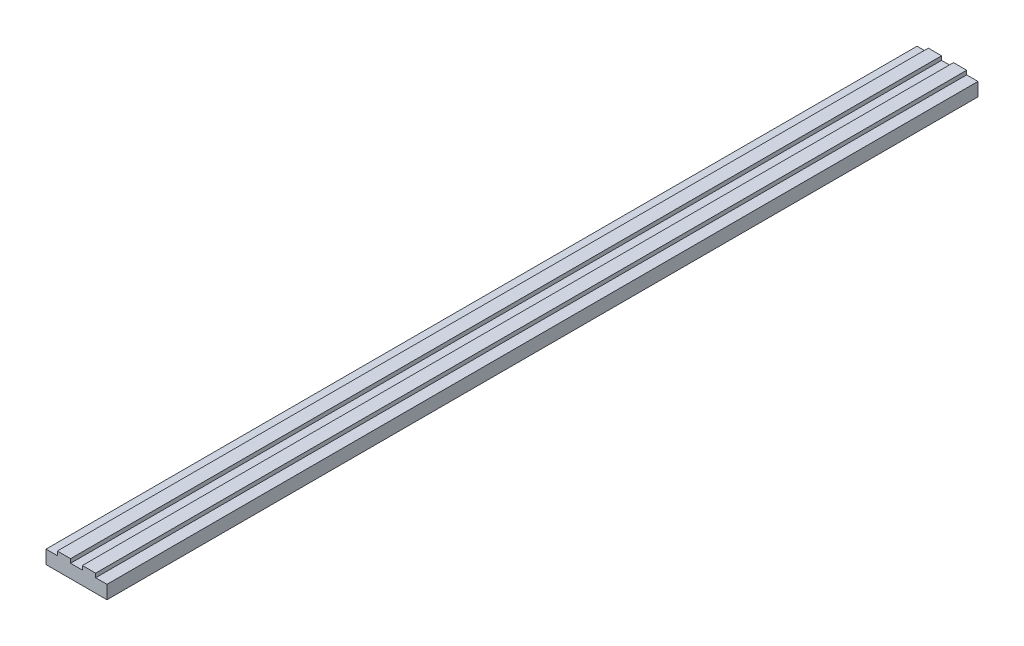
ISO-10303-21;
HEADER;
FILE_DESCRIPTION(('STEP AP214'),'2;1');
FILE_NAME('part.step','',(''),(''),'','','');
FILE_SCHEMA(('AUTOMOTIVE_DESIGN { 1 0 10303 214 1 1 1 1 }'));
ENDSEC;
DATA;
#1=APPLICATION_CONTEXT('core data for automotive mechanical design processes');
#2=APPLICATION_PROTOCOL_DEFINITION('international standard','automotive_design',2000,#1);
#3=PRODUCT_CONTEXT('',#1,'mechanical');
#4=PRODUCT('Part','Part','',(#3));
#5=PRODUCT_RELATED_PRODUCT_CATEGORY('part','',(#4));
#6=PRODUCT_DEFINITION_FORMATION('','',#4);
#7=PRODUCT_DEFINITION_CONTEXT('part definition',#1,'design');
#8=PRODUCT_DEFINITION('design','',#6,#7);
#9=PRODUCT_DEFINITION_SHAPE('','',#8);
#10=(LENGTH_UNIT() NAMED_UNIT(*) SI_UNIT(.MILLI.,.METRE.));
#11=(NAMED_UNIT(*) PLANE_ANGLE_UNIT() SI_UNIT($,.RADIAN.));
#12=(NAMED_UNIT(*) SI_UNIT($,.STERADIAN.) SOLID_ANGLE_UNIT());
#13=UNCERTAINTY_MEASURE_WITH_UNIT(LENGTH_MEASURE(1.E-05),#10,'distance_accuracy_value','');
#14=(GEOMETRIC_REPRESENTATION_CONTEXT(3) GLOBAL_UNCERTAINTY_ASSIGNED_CONTEXT((#13)) GLOBAL_UNIT_ASSIGNED_CONTEXT((#10,
#11,#12)) REPRESENTATION_CONTEXT('',''));
#15=CARTESIAN_POINT('',(0.,0.,0.));
#16=DIRECTION('',(0.,0.,1.));
#17=DIRECTION('',(1.,0.,0.));
#18=AXIS2_PLACEMENT_3D('',#15,#16,#17);
#19=CARTESIAN_POINT('',(-3.3999999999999,10.,0.));
#20=DIRECTION('',(-1.,0.,0.));
#21=DIRECTION('',(0.,0.,1.));
#22=AXIS2_PLACEMENT_3D('',#19,#20,#21);
#23=PLANE('',#22);
#24=DIRECTION('',(0.,-1.,0.));
#25=VECTOR('',#24,1.);
#26=CARTESIAN_POINT('',(-3.3999999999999,10.,500.));
#27=LINE('',#26,#25);
#28=CARTESIAN_POINT('',(-3.3999999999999,10.,500.));
#29=VERTEX_POINT('',#28);
#30=CARTESIAN_POINT('',(-3.3999999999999,7.7,500.));
#31=VERTEX_POINT('',#30);
#32=EDGE_CURVE('E133',#29,#31,#27,.T.);
#33=ORIENTED_EDGE('',*,*,#32,.T.);
#34=DIRECTION('',(0.,0.,1.));
#35=VECTOR('',#34,1.);
#36=CARTESIAN_POINT('',(-3.3999999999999,7.7,0.));
#37=LINE('',#36,#35);
#38=CARTESIAN_POINT('',(-3.3999999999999,7.7,0.));
#39=VERTEX_POINT('',#38);
#40=EDGE_CURVE('E9',#39,#31,#37,.T.);
#41=ORIENTED_EDGE('',*,*,#40,.F.);
#42=DIRECTION('',(0.,-1.,0.));
#43=VECTOR('',#42,1.);
#44=CARTESIAN_POINT('',(-3.3999999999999,10.,0.));
#45=LINE('',#44,#43);
#46=CARTESIAN_POINT('',(-3.3999999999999,10.,0.));
#47=VERTEX_POINT('',#46);
#48=EDGE_CURVE('E161',#47,#39,#45,.T.);
#49=ORIENTED_EDGE('',*,*,#48,.F.);
#50=DIRECTION('',(0.,0.,1.));
#51=VECTOR('',#50,1.);
#52=CARTESIAN_POINT('',(-3.3999999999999,10.,0.));
#53=LINE('',#52,#51);
#54=EDGE_CURVE('E129',#47,#29,#53,.T.);
#55=ORIENTED_EDGE('',*,*,#54,.T.);
#56=EDGE_LOOP('',(#33,#41,#49,#55));
#57=FACE_BOUND('',#56,.T.);
#58=ADVANCED_FACE('F14',(#57),#23,.F.);
#59=CARTESIAN_POINT('',(-3.3999999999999,7.7,0.));
#60=DIRECTION('',(0.,-1.,0.));
#61=DIRECTION('',(0.,0.,-1.));
#62=AXIS2_PLACEMENT_3D('',#59,#60,#61);
#63=PLANE('',#62);
#64=DIRECTION('',(1.,0.,0.));
#65=VECTOR('',#64,1.);
#66=CARTESIAN_POINT('',(-3.3999999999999,7.7,500.));
#67=LINE('',#66,#65);
#68=CARTESIAN_POINT('',(3.40000000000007,7.7,500.));
#69=VERTEX_POINT('',#68);
#70=EDGE_CURVE('E136',#31,#69,#67,.T.);
#71=ORIENTED_EDGE('',*,*,#70,.T.);
#72=DIRECTION('',(0.,0.,1.));
#73=VECTOR('',#72,1.);
#74=CARTESIAN_POINT('',(3.40000000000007,7.7,0.));
#75=LINE('',#74,#73);
#76=CARTESIAN_POINT('',(3.40000000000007,7.7,0.));
#77=VERTEX_POINT('',#76);
#78=EDGE_CURVE('E22',#77,#69,#75,.T.);
#79=ORIENTED_EDGE('',*,*,#78,.F.);
#80=DIRECTION('',(1.,0.,0.));
#81=VECTOR('',#80,1.);
#82=CARTESIAN_POINT('',(-3.3999999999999,7.7,0.));
#83=LINE('',#82,#81);
#84=EDGE_CURVE('E81',#39,#77,#83,.T.);
#85=ORIENTED_EDGE('',*,*,#84,.F.);
#86=ORIENTED_EDGE('',*,*,#40,.T.);
#87=EDGE_LOOP('',(#71,#79,#85,#86));
#88=FACE_BOUND('',#87,.T.);
#89=ADVANCED_FACE('F185',(#88),#63,.F.);
#90=CARTESIAN_POINT('',(3.4,10.,0.));
#91=DIRECTION('',(-1.,0.,0.));
#92=DIRECTION('',(0.,-1.,0.));
#93=AXIS2_PLACEMENT_3D('',#90,#91,#92);
#94=PLANE('',#93);
#95=DIRECTION('',(0.,-1.,0.));
#96=VECTOR('',#95,1.);
#97=CARTESIAN_POINT('',(3.4,10.,500.));
#98=LINE('',#97,#96);
#99=CARTESIAN_POINT('',(3.4,10.,500.));
#100=VERTEX_POINT('',#99);
#101=EDGE_CURVE('E139',#100,#69,#98,.T.);
#102=ORIENTED_EDGE('',*,*,#101,.F.);
#103=DIRECTION('',(0.,0.,1.));
#104=VECTOR('',#103,1.);
#105=CARTESIAN_POINT('',(3.4,10.,0.));
#106=LINE('',#105,#104);
#107=CARTESIAN_POINT('',(3.4,10.,0.));
#108=VERTEX_POINT('',#107);
#109=EDGE_CURVE('E178',#108,#100,#106,.T.);
#110=ORIENTED_EDGE('',*,*,#109,.F.);
#111=DIRECTION('',(0.,-1.,0.));
#112=VECTOR('',#111,1.);
#113=CARTESIAN_POINT('',(3.4,10.,0.));
#114=LINE('',#113,#112);
#115=EDGE_CURVE('E184',#108,#77,#114,.T.);
#116=ORIENTED_EDGE('',*,*,#115,.T.);
#117=ORIENTED_EDGE('',*,*,#78,.T.);
#118=EDGE_LOOP('',(#102,#110,#116,#117));
#119=FACE_BOUND('',#118,.T.);
#120=ADVANCED_FACE('F182',(#119),#94,.T.);
#121=CARTESIAN_POINT('',(3.4,10.,0.));
#122=DIRECTION('',(0.,-1.,0.));
#123=DIRECTION('',(1.,0.,0.));
#124=AXIS2_PLACEMENT_3D('',#121,#122,#123);
#125=PLANE('',#124);
#126=DIRECTION('',(1.,0.,0.));
#127=VECTOR('',#126,1.);
#128=CARTESIAN_POINT('',(3.4,10.,500.));
#129=LINE('',#128,#127);
#130=CARTESIAN_POINT('',(11.,10.,500.));
#131=VERTEX_POINT('',#130);
#132=EDGE_CURVE('E142',#100,#131,#129,.T.);
#133=ORIENTED_EDGE('',*,*,#132,.T.);
#134=DIRECTION('',(0.,0.,1.));
#135=VECTOR('',#134,1.);
#136=CARTESIAN_POINT('',(11.,10.,0.));
#137=LINE('',#136,#135);
#138=CARTESIAN_POINT('',(11.,10.,0.));
#139=VERTEX_POINT('',#138);
#140=EDGE_CURVE('E175',#139,#131,#137,.T.);
#141=ORIENTED_EDGE('',*,*,#140,.F.);
#142=DIRECTION('',(1.,0.,0.));
#143=VECTOR('',#142,1.);
#144=CARTESIAN_POINT('',(3.4,10.,0.));
#145=LINE('',#144,#143);
#146=EDGE_CURVE('E204',#108,#139,#145,.T.);
#147=ORIENTED_EDGE('',*,*,#146,.F.);
#148=ORIENTED_EDGE('',*,*,#109,.T.);
#149=EDGE_LOOP('',(#133,#141,#147,#148));
#150=FACE_BOUND('',#149,.T.);
#151=ADVANCED_FACE('F195',(#150),#125,.F.);
#152=CARTESIAN_POINT('',(11.,10.,0.));
#153=DIRECTION('',(-1.,0.,0.));
#154=DIRECTION('',(0.,0.,1.));
#155=AXIS2_PLACEMENT_3D('',#152,#153,#154);
#156=PLANE('',#155);
#157=DIRECTION('',(0.,-1.,0.));
#158=VECTOR('',#157,1.);
#159=CARTESIAN_POINT('',(11.,10.,500.));
#160=LINE('',#159,#158);
#161=CARTESIAN_POINT('',(11.,7.7,500.));
#162=VERTEX_POINT('',#161);
#163=EDGE_CURVE('E144',#131,#162,#160,.T.);
#164=ORIENTED_EDGE('',*,*,#163,.T.);
#165=DIRECTION('',(0.,0.,1.));
#166=VECTOR('',#165,1.);
#167=CARTESIAN_POINT('',(11.,7.7,0.));
#168=LINE('',#167,#166);
#169=CARTESIAN_POINT('',(11.,7.7,0.));
#170=VERTEX_POINT('',#169);
#171=EDGE_CURVE('E172',#170,#162,#168,.T.);
#172=ORIENTED_EDGE('',*,*,#171,.F.);
#173=DIRECTION('',(0.,-1.,0.));
#174=VECTOR('',#173,1.);
#175=CARTESIAN_POINT('',(11.,10.,0.));
#176=LINE('',#175,#174);
#177=EDGE_CURVE('E201',#139,#170,#176,.T.);
#178=ORIENTED_EDGE('',*,*,#177,.F.);
#179=ORIENTED_EDGE('',*,*,#140,.T.);
#180=EDGE_LOOP('',(#164,#172,#178,#179));
#181=FACE_BOUND('',#180,.T.);
#182=ADVANCED_FACE('F199',(#181),#156,.F.);
#183=CARTESIAN_POINT('',(11.,7.7,0.));
#184=DIRECTION('',(0.,-1.,0.));
#185=DIRECTION('',(0.,0.,-1.));
#186=AXIS2_PLACEMENT_3D('',#183,#184,#185);
#187=PLANE('',#186);
#188=DIRECTION('',(1.,0.,0.));
#189=VECTOR('',#188,1.);
#190=CARTESIAN_POINT('',(11.,7.7,500.));
#191=LINE('',#190,#189);
#192=CARTESIAN_POINT('',(17.5,7.7,500.));
#193=VERTEX_POINT('',#192);
#194=EDGE_CURVE('E146',#162,#193,#191,.T.);
#195=ORIENTED_EDGE('',*,*,#194,.T.);
#196=DIRECTION('',(0.,0.,1.));
#197=VECTOR('',#196,1.);
#198=CARTESIAN_POINT('',(17.5,7.7,0.));
#199=LINE('',#198,#197);
#200=CARTESIAN_POINT('',(17.5,7.7,0.));
#201=VERTEX_POINT('',#200);
#202=EDGE_CURVE('E169',#201,#193,#199,.T.);
#203=ORIENTED_EDGE('',*,*,#202,.F.);
#204=DIRECTION('',(1.,0.,0.));
#205=VECTOR('',#204,1.);
#206=CARTESIAN_POINT('',(11.,7.7,0.));
#207=LINE('',#206,#205);
#208=EDGE_CURVE('E203',#170,#201,#207,.T.);
#209=ORIENTED_EDGE('',*,*,#208,.F.);
#210=ORIENTED_EDGE('',*,*,#171,.T.);
#211=EDGE_LOOP('',(#195,#203,#209,#210));
#212=FACE_BOUND('',#211,.T.);
#213=ADVANCED_FACE('F247',(#212),#187,.F.);
#214=CARTESIAN_POINT('',(17.5,7.7,0.));
#215=DIRECTION('',(-1.,0.,0.));
#216=DIRECTION('',(0.,0.,1.));
#217=AXIS2_PLACEMENT_3D('',#214,#215,#216);
#218=PLANE('',#217);
#219=DIRECTION('',(0.,-1.,0.));
#220=VECTOR('',#219,1.);
#221=CARTESIAN_POINT('',(17.5,7.7,500.));
#222=LINE('',#221,#220);
#223=CARTESIAN_POINT('',(17.5,0.,500.));
#224=VERTEX_POINT('',#223);
#225=EDGE_CURVE('E148',#193,#224,#222,.T.);
#226=ORIENTED_EDGE('',*,*,#225,.T.);
#227=DIRECTION('',(0.,0.,1.));
#228=VECTOR('',#227,1.);
#229=CARTESIAN_POINT('',(17.5,0.,0.));
#230=LINE('',#229,#228);
#231=CARTESIAN_POINT('',(17.5,0.,0.));
#232=VERTEX_POINT('',#231);
#233=EDGE_CURVE('E167',#232,#224,#230,.T.);
#234=ORIENTED_EDGE('',*,*,#233,.F.);
#235=DIRECTION('',(0.,-1.,0.));
#236=VECTOR('',#235,1.);
#237=CARTESIAN_POINT('',(17.5,7.7,0.));
#238=LINE('',#237,#236);
#239=EDGE_CURVE('E206',#201,#232,#238,.T.);
#240=ORIENTED_EDGE('',*,*,#239,.F.);
#241=ORIENTED_EDGE('',*,*,#202,.T.);
#242=EDGE_LOOP('',(#226,#234,#240,#241));
#243=FACE_BOUND('',#242,.T.);
#244=ADVANCED_FACE('F250',(#243),#218,.F.);
#245=CARTESIAN_POINT('',(-17.5,0.,0.));
#246=DIRECTION('',(0.,-1.,0.));
#247=DIRECTION('',(1.,0.,0.));
#248=AXIS2_PLACEMENT_3D('',#245,#246,#247);
#249=PLANE('',#248);
#250=DIRECTION('',(1.,0.,0.));
#251=VECTOR('',#250,1.);
#252=CARTESIAN_POINT('',(-17.5,0.,500.));
#253=LINE('',#252,#251);
#254=CARTESIAN_POINT('',(-17.5,0.,500.));
#255=VERTEX_POINT('',#254);
#256=EDGE_CURVE('E151',#255,#224,#253,.T.);
#257=ORIENTED_EDGE('',*,*,#256,.F.);
#258=DIRECTION('',(0.,0.,1.));
#259=VECTOR('',#258,1.);
#260=CARTESIAN_POINT('',(-17.5,0.,0.));
#261=LINE('',#260,#259);
#262=CARTESIAN_POINT('',(-17.5,0.,0.));
#263=VERTEX_POINT('',#262);
#264=EDGE_CURVE('E165',#263,#255,#261,.T.);
#265=ORIENTED_EDGE('',*,*,#264,.F.);
#266=DIRECTION('',(1.,0.,0.));
#267=VECTOR('',#266,1.);
#268=CARTESIAN_POINT('',(-17.5,0.,0.));
#269=LINE('',#268,#267);
#270=EDGE_CURVE('E212',#263,#232,#269,.T.);
#271=ORIENTED_EDGE('',*,*,#270,.T.);
#272=ORIENTED_EDGE('',*,*,#233,.T.);
#273=EDGE_LOOP('',(#257,#265,#271,#272));
#274=FACE_BOUND('',#273,.T.);
#275=ADVANCED_FACE('F254',(#274),#249,.T.);
#276=CARTESIAN_POINT('',(-17.5,7.7,0.));
#277=DIRECTION('',(-1.,0.,0.));
#278=DIRECTION('',(0.,0.,1.));
#279=AXIS2_PLACEMENT_3D('',#276,#277,#278);
#280=PLANE('',#279);
#281=DIRECTION('',(0.,-1.,0.));
#282=VECTOR('',#281,1.);
#283=CARTESIAN_POINT('',(-17.5,7.7,500.));
#284=LINE('',#283,#282);
#285=CARTESIAN_POINT('',(-17.5,7.7,500.));
#286=VERTEX_POINT('',#285);
#287=EDGE_CURVE('E154',#286,#255,#284,.T.);
#288=ORIENTED_EDGE('',*,*,#287,.F.);
#289=DIRECTION('',(0.,0.,1.));
#290=VECTOR('',#289,1.);
#291=CARTESIAN_POINT('',(-17.5,7.7,0.));
#292=LINE('',#291,#290);
#293=CARTESIAN_POINT('',(-17.5,7.7,0.));
#294=VERTEX_POINT('',#293);
#295=EDGE_CURVE('E125',#294,#286,#292,.T.);
#296=ORIENTED_EDGE('',*,*,#295,.F.);
#297=DIRECTION('',(0.,-1.,0.));
#298=VECTOR('',#297,1.);
#299=CARTESIAN_POINT('',(-17.5,7.7,0.));
#300=LINE('',#299,#298);
#301=EDGE_CURVE('E114',#294,#263,#300,.T.);
#302=ORIENTED_EDGE('',*,*,#301,.T.);
#303=ORIENTED_EDGE('',*,*,#264,.T.);
#304=EDGE_LOOP('',(#288,#296,#302,#303));
#305=FACE_BOUND('',#304,.T.);
#306=ADVANCED_FACE('F216',(#305),#280,.T.);
#307=CARTESIAN_POINT('',(-17.5,7.7,0.));
#308=DIRECTION('',(0.,-1.,0.));
#309=DIRECTION('',(0.,0.,-1.));
#310=AXIS2_PLACEMENT_3D('',#307,#308,#309);
#311=PLANE('',#310);
#312=DIRECTION('',(1.,0.,0.));
#313=VECTOR('',#312,1.);
#314=CARTESIAN_POINT('',(-17.5,7.7,500.));
#315=LINE('',#314,#313);
#316=CARTESIAN_POINT('',(-11.,7.7,500.));
#317=VERTEX_POINT('',#316);
#318=EDGE_CURVE('E121',#286,#317,#315,.T.);
#319=ORIENTED_EDGE('',*,*,#318,.T.);
#320=DIRECTION('',(0.,0.,1.));
#321=VECTOR('',#320,1.);
#322=CARTESIAN_POINT('',(-11.,7.7,0.));
#323=LINE('',#322,#321);
#324=CARTESIAN_POINT('',(-11.,7.7,0.));
#325=VERTEX_POINT('',#324);
#326=EDGE_CURVE('E118',#325,#317,#323,.T.);
#327=ORIENTED_EDGE('',*,*,#326,.F.);
#328=DIRECTION('',(1.,0.,0.));
#329=VECTOR('',#328,1.);
#330=CARTESIAN_POINT('',(-17.5,7.7,0.));
#331=LINE('',#330,#329);
#332=EDGE_CURVE('E107',#294,#325,#331,.T.);
#333=ORIENTED_EDGE('',*,*,#332,.F.);
#334=ORIENTED_EDGE('',*,*,#295,.T.);
#335=EDGE_LOOP('',(#319,#327,#333,#334));
#336=FACE_BOUND('',#335,.T.);
#337=ADVANCED_FACE('F119',(#336),#311,.F.);
#338=CARTESIAN_POINT('',(-11.,10.,0.));
#339=DIRECTION('',(-1.,0.,0.));
#340=DIRECTION('',(0.,0.,1.));
#341=AXIS2_PLACEMENT_3D('',#338,#339,#340);
#342=PLANE('',#341);
#343=DIRECTION('',(0.,-1.,0.));
#344=VECTOR('',#343,1.);
#345=CARTESIAN_POINT('',(-11.,10.,500.));
#346=LINE('',#345,#344);
#347=CARTESIAN_POINT('',(-11.,10.,500.));
#348=VERTEX_POINT('',#347);
#349=EDGE_CURVE('E158',#348,#317,#346,.T.);
#350=ORIENTED_EDGE('',*,*,#349,.F.);
#351=DIRECTION('',(0.,0.,1.));
#352=VECTOR('',#351,1.);
#353=CARTESIAN_POINT('',(-11.,10.,0.));
#354=LINE('',#353,#352);
#355=CARTESIAN_POINT('',(-11.,10.,0.));
#356=VERTEX_POINT('',#355);
#357=EDGE_CURVE('E70',#356,#348,#354,.T.);
#358=ORIENTED_EDGE('',*,*,#357,.F.);
#359=DIRECTION('',(0.,-1.,0.));
#360=VECTOR('',#359,1.);
#361=CARTESIAN_POINT('',(-11.,10.,0.));
#362=LINE('',#361,#360);
#363=EDGE_CURVE('E111',#356,#325,#362,.T.);
#364=ORIENTED_EDGE('',*,*,#363,.T.);
#365=ORIENTED_EDGE('',*,*,#326,.T.);
#366=EDGE_LOOP('',(#350,#358,#364,#365));
#367=FACE_BOUND('',#366,.T.);
#368=ADVANCED_FACE('F127',(#367),#342,.T.);
#369=CARTESIAN_POINT('',(-11.,10.,0.));
#370=DIRECTION('',(0.,-1.,0.));
#371=DIRECTION('',(0.,0.,-1.));
#372=AXIS2_PLACEMENT_3D('',#369,#370,#371);
#373=PLANE('',#372);
#374=DIRECTION('',(1.,0.,0.));
#375=VECTOR('',#374,1.);
#376=CARTESIAN_POINT('',(-11.,10.,500.));
#377=LINE('',#376,#375);
#378=EDGE_CURVE('E73',#348,#29,#377,.T.);
#379=ORIENTED_EDGE('',*,*,#378,.T.);
#380=ORIENTED_EDGE('',*,*,#54,.F.);
#381=DIRECTION('',(1.,0.,0.));
#382=VECTOR('',#381,1.);
#383=CARTESIAN_POINT('',(-11.,10.,0.));
#384=LINE('',#383,#382);
#385=EDGE_CURVE('E30',#356,#47,#384,.T.);
#386=ORIENTED_EDGE('',*,*,#385,.F.);
#387=ORIENTED_EDGE('',*,*,#357,.T.);
#388=EDGE_LOOP('',(#379,#380,#386,#387));
#389=FACE_BOUND('',#388,.T.);
#390=ADVANCED_FACE('F220',(#389),#373,.F.);
#391=CARTESIAN_POINT('',(-3.3999999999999,7.7,0.));
#392=DIRECTION('',(0.,0.,1.));
#393=DIRECTION('',(1.,0.,0.));
#394=AXIS2_PLACEMENT_3D('',#391,#392,#393);
#395=PLANE('',#394);
#396=ORIENTED_EDGE('',*,*,#48,.T.);
#397=ORIENTED_EDGE('',*,*,#84,.T.);
#398=ORIENTED_EDGE('',*,*,#115,.F.);
#399=ORIENTED_EDGE('',*,*,#146,.T.);
#400=ORIENTED_EDGE('',*,*,#177,.T.);
#401=ORIENTED_EDGE('',*,*,#208,.T.);
#402=ORIENTED_EDGE('',*,*,#239,.T.);
#403=ORIENTED_EDGE('',*,*,#270,.F.);
#404=ORIENTED_EDGE('',*,*,#301,.F.);
#405=ORIENTED_EDGE('',*,*,#332,.T.);
#406=ORIENTED_EDGE('',*,*,#363,.F.);
#407=ORIENTED_EDGE('',*,*,#385,.T.);
#408=EDGE_LOOP('',(#396,#397,#398,#399,#400,#401,#402,#403,#404,#405,#406,#407));
#409=FACE_BOUND('',#408,.T.);
#410=ADVANCED_FACE('F109',(#409),#395,.F.);
#411=CARTESIAN_POINT('',(-3.3999999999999,7.7,500.));
#412=DIRECTION('',(0.,0.,1.));
#413=DIRECTION('',(1.,0.,0.));
#414=AXIS2_PLACEMENT_3D('',#411,#412,#413);
#415=PLANE('',#414);
#416=ORIENTED_EDGE('',*,*,#32,.F.);
#417=ORIENTED_EDGE('',*,*,#378,.F.);
#418=ORIENTED_EDGE('',*,*,#349,.T.);
#419=ORIENTED_EDGE('',*,*,#318,.F.);
#420=ORIENTED_EDGE('',*,*,#287,.T.);
#421=ORIENTED_EDGE('',*,*,#256,.T.);
#422=ORIENTED_EDGE('',*,*,#225,.F.);
#423=ORIENTED_EDGE('',*,*,#194,.F.);
#424=ORIENTED_EDGE('',*,*,#163,.F.);
#425=ORIENTED_EDGE('',*,*,#132,.F.);
#426=ORIENTED_EDGE('',*,*,#101,.T.);
#427=ORIENTED_EDGE('',*,*,#70,.F.);
#428=EDGE_LOOP('',(#416,#417,#418,#419,#420,#421,#422,#423,#424,#425,#426,#427));
#429=FACE_BOUND('',#428,.T.);
#430=ADVANCED_FACE('F190',(#429),#415,.T.);
#431=CLOSED_SHELL('',(#58,#89,#120,#151,#182,#213,#244,#275,#306,#337,#368,#390,#410,#430));
#432=MANIFOLD_SOLID_BREP('B1',#431);
#433=ADVANCED_BREP_SHAPE_REPRESENTATION('',(#18,#432),#14);
#434=SHAPE_DEFINITION_REPRESENTATION(#9,#433);
ENDSEC;
END-ISO-10303-21;
